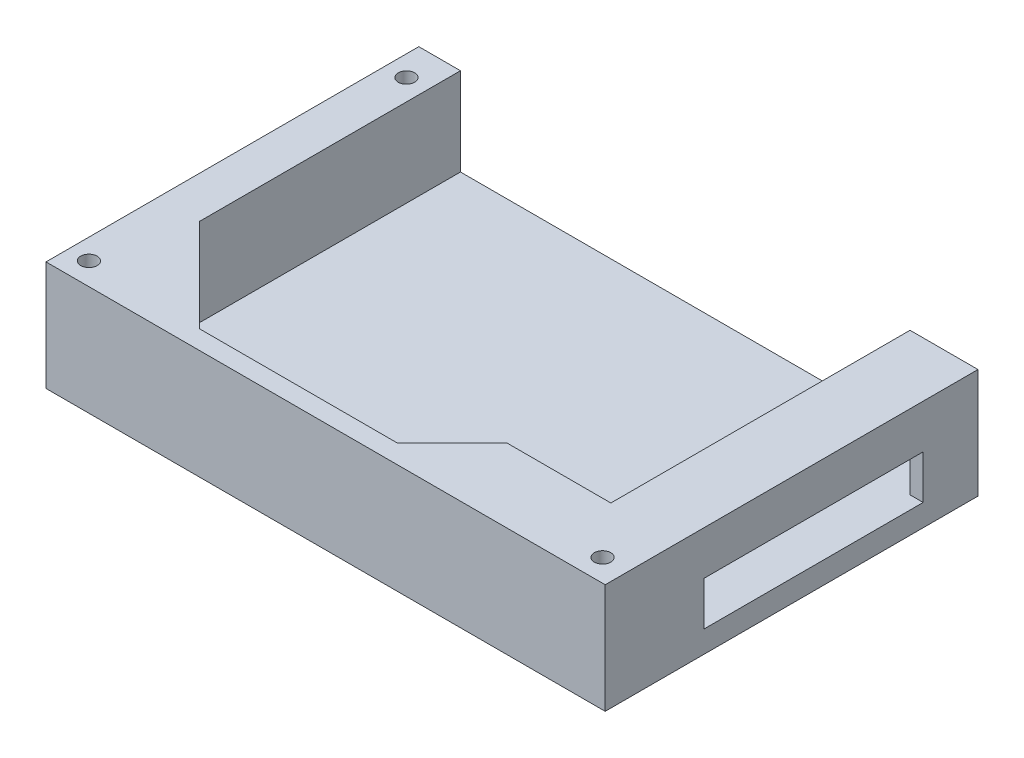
from build123d import *

# Parameters (mm, degrees)
SKETCH1_W               = 102
SKETCH1_H               = 68
BOSS_EXTRUDE1_DEPTH     = 20
CUT_EXTRUDE1_DEPTH      = 125.209500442
CUT_EXTRUDE1_DEPTH_BACK = 16
SKETCH5_W               = 92
SKETCH5_H               = 20.568468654
CUT_EXTRUDE2_DEPTH      = 16
SKETCH6_W               = 10
SKETCH6_H               = 54.568468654
BOSS_EXTRUDE2_DEPTH     = 8
SKETCH9_W               = 40
SKETCH9_H               = 8
CUT_EXTRUDE3_DEPTH      = 8
SKETCH10_R              = 1.5
CUT_EXTRUDE4_DEPTH      = 125.209500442


with BuildPart() as part:
    # Sketch1 → Boss-Extrude1 (new body)
    with BuildSketch(Plane(origin=(0, 0, 0), x_dir=(1, 0, 0), z_dir=(0, 1, 0))):
        with Locations((51, 34)):
            Rectangle(SKETCH1_W, SKETCH1_H)
    extrude(amount=BOSS_EXTRUDE1_DEPTH)

    # Sketch3 → Cut-Extrude1 (cut, two sides: drawn at the far end of the back side and taken through both)
    with BuildSketch(Plane(origin=(0, 20, 0), x_dir=(1, 0, 0), z_dir=(0, 1, 0)).offset(-CUT_EXTRUDE1_DEPTH_BACK)):
        Polygon((16.602187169, 61.431531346), (85.602187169, 61.431531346), (99.602187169, 47.431531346), (99.602187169, 19.431531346), (93.602187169, 13.431531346), (70.602187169, 13.431531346), (60.602187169, 3.431531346), (24.602187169, 3.431531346), (7.602187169, 20.431531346), (7.602187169, 54.431531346), align=None)
    extrude(amount=CUT_EXTRUDE1_DEPTH + CUT_EXTRUDE1_DEPTH_BACK, mode=Mode.SUBTRACT)

    # Sketch5 → Cut-Extrude2 (cut)
    with BuildSketch(Plane(origin=(0, 20, 0), x_dir=(1, 0, 0), z_dir=(0, 1, 0))):
        with Locations((53.602187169, 57.715765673)):
            Rectangle(SKETCH5_W, SKETCH5_H)
    extrude(amount=-CUT_EXTRUDE2_DEPTH, mode=Mode.SUBTRACT)

    # Sketch6 → Boss-Extrude2 (add)
    with BuildSketch(Plane(origin=(0, 20, 0), x_dir=(1, 0, 0), z_dir=(0, 1, 0))):
        with Locations((94.602187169, 40.715765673)):
            Rectangle(SKETCH6_W, SKETCH6_H)
    extrude(amount=-BOSS_EXTRUDE2_DEPTH)

    # Sketch9 → Cut-Extrude3 (cut)
    with BuildSketch(Plane(origin=(102, 0, 0), x_dir=(0, 0, -1), z_dir=(1, 0, 0))):
        with Locations((38, 8)):
            Rectangle(SKETCH9_W, SKETCH9_H)
    extrude(amount=-CUT_EXTRUDE3_DEPTH, mode=Mode.SUBTRACT)

    # Sketch10 → Cut-Extrude4 (cut, through all)
    with BuildSketch(Plane(origin=(0, 20, 0), x_dir=(1, 0, 0), z_dir=(0, 1, 0))):
        with Locations(Location((3.75, 62, 0), (0, 0, 270))):
            Circle(SKETCH10_R)
        with Locations(Location((3.75, 4.076176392, 0), (0, 0, 270))):
            Circle(SKETCH10_R)
        with Locations(Location((97.441924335, 4.076176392, 0), (0, 0, 270))):
            Circle(SKETCH10_R)
    extrude(amount=-CUT_EXTRUDE4_DEPTH, mode=Mode.SUBTRACT)


solid = part.part
